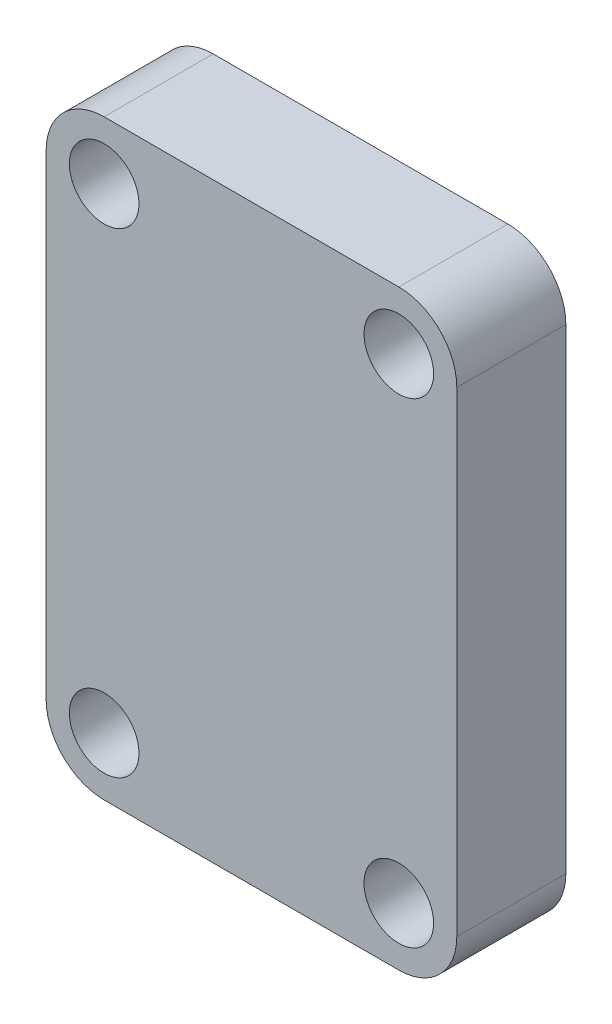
ISO-10303-21;
HEADER;
FILE_DESCRIPTION(('STEP AP214'),'2;1');
FILE_NAME('part.step','',(''),(''),'','','');
FILE_SCHEMA(('AUTOMOTIVE_DESIGN { 1 0 10303 214 1 1 1 1 }'));
ENDSEC;
DATA;
#1=APPLICATION_CONTEXT('core data for automotive mechanical design processes');
#2=APPLICATION_PROTOCOL_DEFINITION('international standard','automotive_design',2000,#1);
#3=PRODUCT_CONTEXT('',#1,'mechanical');
#4=PRODUCT('Part','Part','',(#3));
#5=PRODUCT_RELATED_PRODUCT_CATEGORY('part','',(#4));
#6=PRODUCT_DEFINITION_FORMATION('','',#4);
#7=PRODUCT_DEFINITION_CONTEXT('part definition',#1,'design');
#8=PRODUCT_DEFINITION('design','',#6,#7);
#9=PRODUCT_DEFINITION_SHAPE('','',#8);
#10=(LENGTH_UNIT() NAMED_UNIT(*) SI_UNIT(.MILLI.,.METRE.));
#11=(NAMED_UNIT(*) PLANE_ANGLE_UNIT() SI_UNIT($,.RADIAN.));
#12=(NAMED_UNIT(*) SI_UNIT($,.STERADIAN.) SOLID_ANGLE_UNIT());
#13=UNCERTAINTY_MEASURE_WITH_UNIT(LENGTH_MEASURE(1.E-05),#10,'distance_accuracy_value','');
#14=(GEOMETRIC_REPRESENTATION_CONTEXT(3) GLOBAL_UNCERTAINTY_ASSIGNED_CONTEXT((#13)) GLOBAL_UNIT_ASSIGNED_CONTEXT((#10,
#11,#12)) REPRESENTATION_CONTEXT('',''));
#15=CARTESIAN_POINT('',(0.,0.,0.));
#16=DIRECTION('',(0.,0.,1.));
#17=DIRECTION('',(1.,0.,0.));
#18=AXIS2_PLACEMENT_3D('',#15,#16,#17);
#19=CARTESIAN_POINT('',(-6.35,10.25,4.7));
#20=DIRECTION('',(0.,0.,1.));
#21=DIRECTION('',(1.,0.,0.));
#22=AXIS2_PLACEMENT_3D('',#19,#20,#21);
#23=PLANE('',#22);
#24=CARTESIAN_POINT('',(-6.35,-10.25,4.7));
#25=DIRECTION('',(0.,0.,1.));
#26=DIRECTION('',(1.,0.,0.));
#27=AXIS2_PLACEMENT_3D('',#24,#25,#26);
#28=CIRCLE('',#27,1.5);
#29=CARTESIAN_POINT('',(-4.85,-10.25,4.7));
#30=VERTEX_POINT('',#29);
#31=EDGE_CURVE('E192',#30,#30,#28,.T.);
#32=ORIENTED_EDGE('',*,*,#31,.F.);
#33=EDGE_LOOP('',(#32));
#34=FACE_BOUND('',#33,.T.);
#35=CARTESIAN_POINT('',(-6.35,10.25,4.7));
#36=DIRECTION('',(0.,0.,1.));
#37=DIRECTION('',(1.,0.,0.));
#38=AXIS2_PLACEMENT_3D('',#35,#36,#37);
#39=CIRCLE('',#38,1.5);
#40=CARTESIAN_POINT('',(-4.85,10.25,4.7));
#41=VERTEX_POINT('',#40);
#42=EDGE_CURVE('E138',#41,#41,#39,.T.);
#43=ORIENTED_EDGE('',*,*,#42,.F.);
#44=EDGE_LOOP('',(#43));
#45=FACE_BOUND('',#44,.T.);
#46=CARTESIAN_POINT('',(-6.35,10.25,4.7));
#47=DIRECTION('',(0.,0.,1.));
#48=DIRECTION('',(1.,0.,0.));
#49=AXIS2_PLACEMENT_3D('',#46,#47,#48);
#50=CIRCLE('',#49,2.5);
#51=CARTESIAN_POINT('',(-6.34999999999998,12.75,4.7));
#52=VERTEX_POINT('',#51);
#53=CARTESIAN_POINT('',(-8.85,10.25,4.7));
#54=VERTEX_POINT('',#53);
#55=EDGE_CURVE('E149',#52,#54,#50,.T.);
#56=ORIENTED_EDGE('',*,*,#55,.T.);
#57=DIRECTION('',(0.,-1.,0.));
#58=VECTOR('',#57,1.);
#59=CARTESIAN_POINT('',(-8.85,-10.25,4.7));
#60=LINE('',#59,#58);
#61=CARTESIAN_POINT('',(-8.85,-10.25,4.7));
#62=VERTEX_POINT('',#61);
#63=EDGE_CURVE('E97',#54,#62,#60,.T.);
#64=ORIENTED_EDGE('',*,*,#63,.T.);
#65=CARTESIAN_POINT('',(-6.35,-10.25,4.7));
#66=DIRECTION('',(0.,0.,1.));
#67=DIRECTION('',(-1.,0.,0.));
#68=AXIS2_PLACEMENT_3D('',#65,#66,#67);
#69=CIRCLE('',#68,2.5);
#70=CARTESIAN_POINT('',(-6.34999999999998,-12.75,4.7));
#71=VERTEX_POINT('',#70);
#72=EDGE_CURVE('E164',#62,#71,#69,.T.);
#73=ORIENTED_EDGE('',*,*,#72,.T.);
#74=DIRECTION('',(1.,0.,0.));
#75=VECTOR('',#74,1.);
#76=CARTESIAN_POINT('',(6.34999999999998,-12.75,4.7));
#77=LINE('',#76,#75);
#78=CARTESIAN_POINT('',(6.34999999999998,-12.75,4.7));
#79=VERTEX_POINT('',#78);
#80=EDGE_CURVE('E177',#71,#79,#77,.T.);
#81=ORIENTED_EDGE('',*,*,#80,.T.);
#82=CARTESIAN_POINT('',(6.35,-10.25,4.7));
#83=DIRECTION('',(0.,0.,1.));
#84=DIRECTION('',(1.,0.,0.));
#85=AXIS2_PLACEMENT_3D('',#82,#83,#84);
#86=CIRCLE('',#85,2.5);
#87=CARTESIAN_POINT('',(8.85,-10.25,4.7));
#88=VERTEX_POINT('',#87);
#89=EDGE_CURVE('E116',#79,#88,#86,.T.);
#90=ORIENTED_EDGE('',*,*,#89,.T.);
#91=DIRECTION('',(0.,1.,0.));
#92=VECTOR('',#91,1.);
#93=CARTESIAN_POINT('',(8.85,-10.25,4.7));
#94=LINE('',#93,#92);
#95=CARTESIAN_POINT('',(8.85,10.25,4.7));
#96=VERTEX_POINT('',#95);
#97=EDGE_CURVE('E110',#88,#96,#94,.T.);
#98=ORIENTED_EDGE('',*,*,#97,.T.);
#99=CARTESIAN_POINT('',(6.35,10.25,4.7));
#100=DIRECTION('',(0.,0.,1.));
#101=DIRECTION('',(1.,0.,0.));
#102=AXIS2_PLACEMENT_3D('',#99,#100,#101);
#103=CIRCLE('',#102,2.5);
#104=CARTESIAN_POINT('',(6.34999999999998,12.75,4.7));
#105=VERTEX_POINT('',#104);
#106=EDGE_CURVE('E114',#96,#105,#103,.T.);
#107=ORIENTED_EDGE('',*,*,#106,.T.);
#108=DIRECTION('',(-1.,0.,0.));
#109=VECTOR('',#108,1.);
#110=CARTESIAN_POINT('',(6.34999999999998,12.75,4.7));
#111=LINE('',#110,#109);
#112=EDGE_CURVE('E54',#105,#52,#111,.T.);
#113=ORIENTED_EDGE('',*,*,#112,.T.);
#114=EDGE_LOOP('',(#56,#64,#73,#81,#90,#98,#107,#113));
#115=FACE_BOUND('',#114,.T.);
#116=CARTESIAN_POINT('',(6.35,10.25,4.7));
#117=DIRECTION('',(0.,0.,1.));
#118=DIRECTION('',(1.,0.,0.));
#119=AXIS2_PLACEMENT_3D('',#116,#117,#118);
#120=CIRCLE('',#119,1.5);
#121=CARTESIAN_POINT('',(7.85,10.25,4.7));
#122=VERTEX_POINT('',#121);
#123=EDGE_CURVE('E186',#122,#122,#120,.T.);
#124=ORIENTED_EDGE('',*,*,#123,.F.);
#125=EDGE_LOOP('',(#124));
#126=FACE_BOUND('',#125,.T.);
#127=CARTESIAN_POINT('',(6.35,-10.25,4.7));
#128=DIRECTION('',(0.,0.,1.));
#129=DIRECTION('',(1.,0.,0.));
#130=AXIS2_PLACEMENT_3D('',#127,#128,#129);
#131=CIRCLE('',#130,1.5);
#132=CARTESIAN_POINT('',(7.85,-10.25,4.7));
#133=VERTEX_POINT('',#132);
#134=EDGE_CURVE('E198',#133,#133,#131,.T.);
#135=ORIENTED_EDGE('',*,*,#134,.F.);
#136=EDGE_LOOP('',(#135));
#137=FACE_BOUND('',#136,.T.);
#138=ADVANCED_FACE('F37',(#34,#45,#115,#126,#137),#23,.T.);
#139=CARTESIAN_POINT('',(-6.35,10.25,0.));
#140=DIRECTION('',(0.,0.,1.));
#141=DIRECTION('',(1.,0.,0.));
#142=AXIS2_PLACEMENT_3D('',#139,#140,#141);
#143=PLANE('',#142);
#144=CARTESIAN_POINT('',(-6.35,10.25,0.));
#145=DIRECTION('',(0.,0.,1.));
#146=DIRECTION('',(1.,0.,0.));
#147=AXIS2_PLACEMENT_3D('',#144,#145,#146);
#148=CIRCLE('',#147,2.5);
#149=CARTESIAN_POINT('',(-6.34999999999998,12.75,0.));
#150=VERTEX_POINT('',#149);
#151=CARTESIAN_POINT('',(-8.85,10.25,0.));
#152=VERTEX_POINT('',#151);
#153=EDGE_CURVE('E134',#150,#152,#148,.T.);
#154=ORIENTED_EDGE('',*,*,#153,.F.);
#155=DIRECTION('',(-1.,0.,0.));
#156=VECTOR('',#155,1.);
#157=CARTESIAN_POINT('',(6.34999999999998,12.75,0.));
#158=LINE('',#157,#156);
#159=CARTESIAN_POINT('',(6.34999999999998,12.75,0.));
#160=VERTEX_POINT('',#159);
#161=EDGE_CURVE('E89',#160,#150,#158,.T.);
#162=ORIENTED_EDGE('',*,*,#161,.F.);
#163=CARTESIAN_POINT('',(6.35,10.25,0.));
#164=DIRECTION('',(0.,0.,1.));
#165=DIRECTION('',(1.,0.,0.));
#166=AXIS2_PLACEMENT_3D('',#163,#164,#165);
#167=CIRCLE('',#166,2.5);
#168=CARTESIAN_POINT('',(8.85,10.25,0.));
#169=VERTEX_POINT('',#168);
#170=EDGE_CURVE('E83',#169,#160,#167,.T.);
#171=ORIENTED_EDGE('',*,*,#170,.F.);
#172=DIRECTION('',(0.,1.,0.));
#173=VECTOR('',#172,1.);
#174=CARTESIAN_POINT('',(8.85,-10.25,0.));
#175=LINE('',#174,#173);
#176=CARTESIAN_POINT('',(8.85,-10.25,0.));
#177=VERTEX_POINT('',#176);
#178=EDGE_CURVE('E124',#177,#169,#175,.T.);
#179=ORIENTED_EDGE('',*,*,#178,.F.);
#180=CARTESIAN_POINT('',(6.35,-10.25,0.));
#181=DIRECTION('',(0.,0.,1.));
#182=DIRECTION('',(1.,0.,0.));
#183=AXIS2_PLACEMENT_3D('',#180,#181,#182);
#184=CIRCLE('',#183,2.5);
#185=CARTESIAN_POINT('',(6.34999999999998,-12.75,0.));
#186=VERTEX_POINT('',#185);
#187=EDGE_CURVE('E144',#186,#177,#184,.T.);
#188=ORIENTED_EDGE('',*,*,#187,.F.);
#189=DIRECTION('',(1.,0.,0.));
#190=VECTOR('',#189,1.);
#191=CARTESIAN_POINT('',(6.34999999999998,-12.75,0.));
#192=LINE('',#191,#190);
#193=CARTESIAN_POINT('',(-6.34999999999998,-12.75,0.));
#194=VERTEX_POINT('',#193);
#195=EDGE_CURVE('E142',#194,#186,#192,.T.);
#196=ORIENTED_EDGE('',*,*,#195,.F.);
#197=CARTESIAN_POINT('',(-6.35,-10.25,0.));
#198=DIRECTION('',(0.,0.,1.));
#199=DIRECTION('',(-1.,0.,0.));
#200=AXIS2_PLACEMENT_3D('',#197,#198,#199);
#201=CIRCLE('',#200,2.5);
#202=CARTESIAN_POINT('',(-8.85,-10.25,0.));
#203=VERTEX_POINT('',#202);
#204=EDGE_CURVE('E140',#203,#194,#201,.T.);
#205=ORIENTED_EDGE('',*,*,#204,.F.);
#206=DIRECTION('',(0.,-1.,0.));
#207=VECTOR('',#206,1.);
#208=CARTESIAN_POINT('',(-8.85,-10.25,0.));
#209=LINE('',#208,#207);
#210=EDGE_CURVE('E137',#152,#203,#209,.T.);
#211=ORIENTED_EDGE('',*,*,#210,.F.);
#212=EDGE_LOOP('',(#154,#162,#171,#179,#188,#196,#205,#211));
#213=FACE_BOUND('',#212,.T.);
#214=CARTESIAN_POINT('',(-6.35,10.25,0.));
#215=DIRECTION('',(0.,0.,1.));
#216=DIRECTION('',(1.,0.,0.));
#217=AXIS2_PLACEMENT_3D('',#214,#215,#216);
#218=CIRCLE('',#217,1.5);
#219=CARTESIAN_POINT('',(-4.85,10.25,0.));
#220=VERTEX_POINT('',#219);
#221=EDGE_CURVE('E183',#220,#220,#218,.T.);
#222=ORIENTED_EDGE('',*,*,#221,.T.);
#223=EDGE_LOOP('',(#222));
#224=FACE_BOUND('',#223,.T.);
#225=CARTESIAN_POINT('',(6.35,10.25,0.));
#226=DIRECTION('',(0.,0.,1.));
#227=DIRECTION('',(1.,0.,0.));
#228=AXIS2_PLACEMENT_3D('',#225,#226,#227);
#229=CIRCLE('',#228,1.5);
#230=CARTESIAN_POINT('',(7.85,10.25,0.));
#231=VERTEX_POINT('',#230);
#232=EDGE_CURVE('E189',#231,#231,#229,.T.);
#233=ORIENTED_EDGE('',*,*,#232,.T.);
#234=EDGE_LOOP('',(#233));
#235=FACE_BOUND('',#234,.T.);
#236=CARTESIAN_POINT('',(-6.35,-10.25,0.));
#237=DIRECTION('',(0.,0.,1.));
#238=DIRECTION('',(1.,0.,0.));
#239=AXIS2_PLACEMENT_3D('',#236,#237,#238);
#240=CIRCLE('',#239,1.5);
#241=CARTESIAN_POINT('',(-4.85,-10.25,0.));
#242=VERTEX_POINT('',#241);
#243=EDGE_CURVE('E195',#242,#242,#240,.T.);
#244=ORIENTED_EDGE('',*,*,#243,.T.);
#245=EDGE_LOOP('',(#244));
#246=FACE_BOUND('',#245,.T.);
#247=CARTESIAN_POINT('',(6.35,-10.25,0.));
#248=DIRECTION('',(0.,0.,1.));
#249=DIRECTION('',(1.,0.,0.));
#250=AXIS2_PLACEMENT_3D('',#247,#248,#249);
#251=CIRCLE('',#250,1.5);
#252=CARTESIAN_POINT('',(7.85,-10.25,0.));
#253=VERTEX_POINT('',#252);
#254=EDGE_CURVE('E201',#253,#253,#251,.T.);
#255=ORIENTED_EDGE('',*,*,#254,.T.);
#256=EDGE_LOOP('',(#255));
#257=FACE_BOUND('',#256,.T.);
#258=ADVANCED_FACE('F168',(#213,#224,#235,#246,#257),#143,.F.);
#259=CARTESIAN_POINT('',(-6.35,10.25,4.7));
#260=DIRECTION('',(0.,0.,-1.));
#261=DIRECTION('',(-1.,0.,0.));
#262=AXIS2_PLACEMENT_3D('',#259,#260,#261);
#263=CYLINDRICAL_SURFACE('',#262,2.5);
#264=ORIENTED_EDGE('',*,*,#153,.T.);
#265=DIRECTION('',(0.,0.,-1.));
#266=VECTOR('',#265,1.);
#267=CARTESIAN_POINT('',(-8.85,10.25,4.7));
#268=LINE('',#267,#266);
#269=EDGE_CURVE('E11',#54,#152,#268,.T.);
#270=ORIENTED_EDGE('',*,*,#269,.F.);
#271=ORIENTED_EDGE('',*,*,#55,.F.);
#272=DIRECTION('',(0.,0.,-1.));
#273=VECTOR('',#272,1.);
#274=CARTESIAN_POINT('',(-6.34999999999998,12.75,4.7));
#275=LINE('',#274,#273);
#276=EDGE_CURVE('E130',#52,#150,#275,.T.);
#277=ORIENTED_EDGE('',*,*,#276,.T.);
#278=EDGE_LOOP('',(#264,#270,#271,#277));
#279=FACE_BOUND('',#278,.T.);
#280=ADVANCED_FACE('F39',(#279),#263,.T.);
#281=CARTESIAN_POINT('',(-8.85,-10.25,4.7));
#282=DIRECTION('',(1.,0.,0.));
#283=DIRECTION('',(0.,0.,-1.));
#284=AXIS2_PLACEMENT_3D('',#281,#282,#283);
#285=PLANE('',#284);
#286=ORIENTED_EDGE('',*,*,#210,.T.);
#287=DIRECTION('',(0.,0.,-1.));
#288=VECTOR('',#287,1.);
#289=CARTESIAN_POINT('',(-8.85,-10.25,4.7));
#290=LINE('',#289,#288);
#291=EDGE_CURVE('E46',#62,#203,#290,.T.);
#292=ORIENTED_EDGE('',*,*,#291,.F.);
#293=ORIENTED_EDGE('',*,*,#63,.F.);
#294=ORIENTED_EDGE('',*,*,#269,.T.);
#295=EDGE_LOOP('',(#286,#292,#293,#294));
#296=FACE_BOUND('',#295,.T.);
#297=ADVANCED_FACE('F235',(#296),#285,.F.);
#298=CARTESIAN_POINT('',(-6.35,-10.25,4.7));
#299=DIRECTION('',(0.,0.,-1.));
#300=DIRECTION('',(-1.,0.,0.));
#301=AXIS2_PLACEMENT_3D('',#298,#299,#300);
#302=CYLINDRICAL_SURFACE('',#301,2.5);
#303=ORIENTED_EDGE('',*,*,#204,.T.);
#304=DIRECTION('',(0.,0.,-1.));
#305=VECTOR('',#304,1.);
#306=CARTESIAN_POINT('',(-6.34999999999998,-12.75,4.7));
#307=LINE('',#306,#305);
#308=EDGE_CURVE('E156',#71,#194,#307,.T.);
#309=ORIENTED_EDGE('',*,*,#308,.F.);
#310=ORIENTED_EDGE('',*,*,#72,.F.);
#311=ORIENTED_EDGE('',*,*,#291,.T.);
#312=EDGE_LOOP('',(#303,#309,#310,#311));
#313=FACE_BOUND('',#312,.T.);
#314=ADVANCED_FACE('F162',(#313),#302,.T.);
#315=CARTESIAN_POINT('',(6.34999999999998,-12.75,4.7));
#316=DIRECTION('',(0.,1.,0.));
#317=DIRECTION('',(-1.,0.,0.));
#318=AXIS2_PLACEMENT_3D('',#315,#316,#317);
#319=PLANE('',#318);
#320=ORIENTED_EDGE('',*,*,#195,.T.);
#321=DIRECTION('',(0.,0.,-1.));
#322=VECTOR('',#321,1.);
#323=CARTESIAN_POINT('',(6.34999999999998,-12.75,4.7));
#324=LINE('',#323,#322);
#325=EDGE_CURVE('E153',#79,#186,#324,.T.);
#326=ORIENTED_EDGE('',*,*,#325,.F.);
#327=ORIENTED_EDGE('',*,*,#80,.F.);
#328=ORIENTED_EDGE('',*,*,#308,.T.);
#329=EDGE_LOOP('',(#320,#326,#327,#328));
#330=FACE_BOUND('',#329,.T.);
#331=ADVANCED_FACE('F173',(#330),#319,.F.);
#332=CARTESIAN_POINT('',(6.35,-10.25,4.7));
#333=DIRECTION('',(0.,0.,-1.));
#334=DIRECTION('',(-1.,0.,0.));
#335=AXIS2_PLACEMENT_3D('',#332,#333,#334);
#336=CYLINDRICAL_SURFACE('',#335,2.5);
#337=ORIENTED_EDGE('',*,*,#187,.T.);
#338=DIRECTION('',(0.,0.,-1.));
#339=VECTOR('',#338,1.);
#340=CARTESIAN_POINT('',(8.85,-10.25,4.7));
#341=LINE('',#340,#339);
#342=EDGE_CURVE('E125',#88,#177,#341,.T.);
#343=ORIENTED_EDGE('',*,*,#342,.F.);
#344=ORIENTED_EDGE('',*,*,#89,.F.);
#345=ORIENTED_EDGE('',*,*,#325,.T.);
#346=EDGE_LOOP('',(#337,#343,#344,#345));
#347=FACE_BOUND('',#346,.T.);
#348=ADVANCED_FACE('F176',(#347),#336,.T.);
#349=CARTESIAN_POINT('',(8.85,-10.25,4.7));
#350=DIRECTION('',(-1.,0.,0.));
#351=DIRECTION('',(0.,0.,1.));
#352=AXIS2_PLACEMENT_3D('',#349,#350,#351);
#353=PLANE('',#352);
#354=ORIENTED_EDGE('',*,*,#178,.T.);
#355=DIRECTION('',(0.,0.,-1.));
#356=VECTOR('',#355,1.);
#357=CARTESIAN_POINT('',(8.85,10.25,4.7));
#358=LINE('',#357,#356);
#359=EDGE_CURVE('E121',#96,#169,#358,.T.);
#360=ORIENTED_EDGE('',*,*,#359,.F.);
#361=ORIENTED_EDGE('',*,*,#97,.F.);
#362=ORIENTED_EDGE('',*,*,#342,.T.);
#363=EDGE_LOOP('',(#354,#360,#361,#362));
#364=FACE_BOUND('',#363,.T.);
#365=ADVANCED_FACE('F122',(#364),#353,.F.);
#366=CARTESIAN_POINT('',(6.35,10.25,4.7));
#367=DIRECTION('',(0.,0.,-1.));
#368=DIRECTION('',(-1.,0.,0.));
#369=AXIS2_PLACEMENT_3D('',#366,#367,#368);
#370=CYLINDRICAL_SURFACE('',#369,2.5);
#371=ORIENTED_EDGE('',*,*,#170,.T.);
#372=DIRECTION('',(0.,0.,-1.));
#373=VECTOR('',#372,1.);
#374=CARTESIAN_POINT('',(6.34999999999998,12.75,4.7));
#375=LINE('',#374,#373);
#376=EDGE_CURVE('E126',#105,#160,#375,.T.);
#377=ORIENTED_EDGE('',*,*,#376,.F.);
#378=ORIENTED_EDGE('',*,*,#106,.F.);
#379=ORIENTED_EDGE('',*,*,#359,.T.);
#380=EDGE_LOOP('',(#371,#377,#378,#379));
#381=FACE_BOUND('',#380,.T.);
#382=ADVANCED_FACE('F128',(#381),#370,.T.);
#383=CARTESIAN_POINT('',(6.34999999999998,12.75,4.7));
#384=DIRECTION('',(0.,-1.,0.));
#385=DIRECTION('',(1.,0.,0.));
#386=AXIS2_PLACEMENT_3D('',#383,#384,#385);
#387=PLANE('',#386);
#388=ORIENTED_EDGE('',*,*,#161,.T.);
#389=ORIENTED_EDGE('',*,*,#276,.F.);
#390=ORIENTED_EDGE('',*,*,#112,.F.);
#391=ORIENTED_EDGE('',*,*,#376,.T.);
#392=EDGE_LOOP('',(#388,#389,#390,#391));
#393=FACE_BOUND('',#392,.T.);
#394=ADVANCED_FACE('F223',(#393),#387,.F.);
#395=CARTESIAN_POINT('',(-6.35,10.25,4.7));
#396=DIRECTION('',(0.,0.,-1.));
#397=DIRECTION('',(-1.,0.,0.));
#398=AXIS2_PLACEMENT_3D('',#395,#396,#397);
#399=CYLINDRICAL_SURFACE('',#398,1.5);
#400=ORIENTED_EDGE('',*,*,#42,.T.);
#401=EDGE_LOOP('',(#400));
#402=FACE_BOUND('',#401,.T.);
#403=ORIENTED_EDGE('',*,*,#221,.F.);
#404=EDGE_LOOP('',(#403));
#405=FACE_BOUND('',#404,.T.);
#406=ADVANCED_FACE('F220',(#402,#405),#399,.F.);
#407=CARTESIAN_POINT('',(6.35,10.25,4.7));
#408=DIRECTION('',(0.,0.,-1.));
#409=DIRECTION('',(-1.,0.,0.));
#410=AXIS2_PLACEMENT_3D('',#407,#408,#409);
#411=CYLINDRICAL_SURFACE('',#410,1.5);
#412=ORIENTED_EDGE('',*,*,#123,.T.);
#413=EDGE_LOOP('',(#412));
#414=FACE_BOUND('',#413,.T.);
#415=ORIENTED_EDGE('',*,*,#232,.F.);
#416=EDGE_LOOP('',(#415));
#417=FACE_BOUND('',#416,.T.);
#418=ADVANCED_FACE('F311',(#414,#417),#411,.F.);
#419=CARTESIAN_POINT('',(-6.35,-10.25,4.7));
#420=DIRECTION('',(0.,0.,-1.));
#421=DIRECTION('',(-1.,0.,0.));
#422=AXIS2_PLACEMENT_3D('',#419,#420,#421);
#423=CYLINDRICAL_SURFACE('',#422,1.5);
#424=ORIENTED_EDGE('',*,*,#31,.T.);
#425=EDGE_LOOP('',(#424));
#426=FACE_BOUND('',#425,.T.);
#427=ORIENTED_EDGE('',*,*,#243,.F.);
#428=EDGE_LOOP('',(#427));
#429=FACE_BOUND('',#428,.T.);
#430=ADVANCED_FACE('F320',(#426,#429),#423,.F.);
#431=CARTESIAN_POINT('',(6.35,-10.25,4.7));
#432=DIRECTION('',(0.,0.,-1.));
#433=DIRECTION('',(-1.,0.,0.));
#434=AXIS2_PLACEMENT_3D('',#431,#432,#433);
#435=CYLINDRICAL_SURFACE('',#434,1.5);
#436=ORIENTED_EDGE('',*,*,#134,.T.);
#437=EDGE_LOOP('',(#436));
#438=FACE_BOUND('',#437,.T.);
#439=ORIENTED_EDGE('',*,*,#254,.F.);
#440=EDGE_LOOP('',(#439));
#441=FACE_BOUND('',#440,.T.);
#442=ADVANCED_FACE('F207',(#438,#441),#435,.F.);
#443=CLOSED_SHELL('',(#138,#258,#280,#297,#314,#331,#348,#365,#382,#394,#406,#418,#430,#442));
#444=MANIFOLD_SOLID_BREP('B2',#443);
#445=ADVANCED_BREP_SHAPE_REPRESENTATION('',(#18,#444),#14);
#446=SHAPE_DEFINITION_REPRESENTATION(#9,#445);
ENDSEC;
END-ISO-10303-21;
